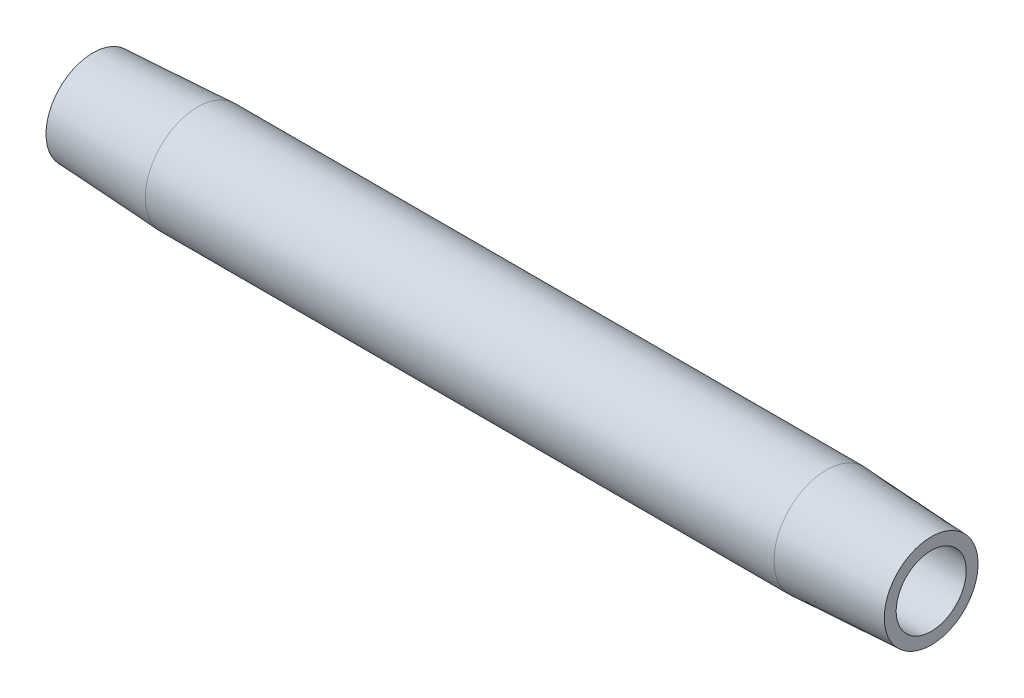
ISO-10303-21;
HEADER;
FILE_DESCRIPTION(('STEP AP214'),'2;1');
FILE_NAME('part.step','',(''),(''),'','','');
FILE_SCHEMA(('AUTOMOTIVE_DESIGN { 1 0 10303 214 1 1 1 1 }'));
ENDSEC;
DATA;
#1=APPLICATION_CONTEXT('core data for automotive mechanical design processes');
#2=APPLICATION_PROTOCOL_DEFINITION('international standard','automotive_design',2000,#1);
#3=PRODUCT_CONTEXT('',#1,'mechanical');
#4=PRODUCT('Part','Part','',(#3));
#5=PRODUCT_RELATED_PRODUCT_CATEGORY('part','',(#4));
#6=PRODUCT_DEFINITION_FORMATION('','',#4);
#7=PRODUCT_DEFINITION_CONTEXT('part definition',#1,'design');
#8=PRODUCT_DEFINITION('design','',#6,#7);
#9=PRODUCT_DEFINITION_SHAPE('','',#8);
#10=(LENGTH_UNIT() NAMED_UNIT(*) SI_UNIT(.MILLI.,.METRE.));
#11=(NAMED_UNIT(*) PLANE_ANGLE_UNIT() SI_UNIT($,.RADIAN.));
#12=(NAMED_UNIT(*) SI_UNIT($,.STERADIAN.) SOLID_ANGLE_UNIT());
#13=UNCERTAINTY_MEASURE_WITH_UNIT(LENGTH_MEASURE(1.E-05),#10,'distance_accuracy_value','');
#14=(GEOMETRIC_REPRESENTATION_CONTEXT(3) GLOBAL_UNCERTAINTY_ASSIGNED_CONTEXT((#13)) GLOBAL_UNIT_ASSIGNED_CONTEXT((#10,
#11,#12)) REPRESENTATION_CONTEXT('',''));
#15=CARTESIAN_POINT('',(0.,0.,0.));
#16=DIRECTION('',(0.,0.,1.));
#17=DIRECTION('',(1.,0.,0.));
#18=AXIS2_PLACEMENT_3D('',#15,#16,#17);
#19=CARTESIAN_POINT('',(0.476141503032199,0.,0.));
#20=DIRECTION('',(-1.,0.,0.));
#21=DIRECTION('',(0.,0.,1.));
#22=AXIS2_PLACEMENT_3D('',#19,#20,#21);
#23=CYLINDRICAL_SURFACE('',#22,3.96875);
#24=CARTESIAN_POINT('',(7.9375,0.,0.));
#25=DIRECTION('',(-1.,0.,0.));
#26=DIRECTION('',(0.,0.,1.));
#27=AXIS2_PLACEMENT_3D('',#24,#25,#26);
#28=CIRCLE('',#27,3.96875);
#29=CARTESIAN_POINT('',(7.9375,0.,3.96875));
#30=VERTEX_POINT('',#29);
#31=EDGE_CURVE('E10',#30,#30,#28,.T.);
#32=ORIENTED_EDGE('',*,*,#31,.F.);
#33=EDGE_LOOP('',(#32));
#34=FACE_BOUND('',#33,.T.);
#35=CARTESIAN_POINT('',(55.5625,0.,0.));
#36=DIRECTION('',(-1.,0.,0.));
#37=DIRECTION('',(0.,0.,1.));
#38=AXIS2_PLACEMENT_3D('',#35,#36,#37);
#39=CIRCLE('',#38,3.96875000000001);
#40=CARTESIAN_POINT('',(55.5625,0.,3.96875000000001));
#41=VERTEX_POINT('',#40);
#42=EDGE_CURVE('E52',#41,#41,#39,.T.);
#43=ORIENTED_EDGE('',*,*,#42,.T.);
#44=EDGE_LOOP('',(#43));
#45=FACE_BOUND('',#44,.T.);
#46=ADVANCED_FACE('F30',(#34,#45),#23,.T.);
#47=CARTESIAN_POINT('',(7.9375,0.,0.));
#48=DIRECTION('',(1.,0.,0.));
#49=DIRECTION('',(0.,0.,-1.));
#50=AXIS2_PLACEMENT_3D('',#47,#48,#49);
#51=CONICAL_SURFACE('',#50,3.96875,0.0523598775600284);
#52=CARTESIAN_POINT('',(0.,0.,0.));
#53=DIRECTION('',(-1.,0.,0.));
#54=DIRECTION('',(0.,0.,1.));
#55=AXIS2_PLACEMENT_3D('',#52,#53,#54);
#56=CIRCLE('',#55,3.55276325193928);
#57=CARTESIAN_POINT('',(0.,0.,3.55276325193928));
#58=VERTEX_POINT('',#57);
#59=EDGE_CURVE('E36',#58,#58,#56,.T.);
#60=ORIENTED_EDGE('',*,*,#59,.F.);
#61=EDGE_LOOP('',(#60));
#62=FACE_BOUND('',#61,.T.);
#63=ORIENTED_EDGE('',*,*,#31,.T.);
#64=EDGE_LOOP('',(#63));
#65=FACE_BOUND('',#64,.T.);
#66=ADVANCED_FACE('F77',(#62,#65),#51,.T.);
#67=CARTESIAN_POINT('',(0.,3.55276325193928,0.));
#68=DIRECTION('',(1.,0.,0.));
#69=DIRECTION('',(0.,0.,-1.));
#70=AXIS2_PLACEMENT_3D('',#67,#68,#69);
#71=PLANE('',#70);
#72=CARTESIAN_POINT('',(0.,0.,0.));
#73=DIRECTION('',(-1.,0.,0.));
#74=DIRECTION('',(0.,0.,1.));
#75=AXIS2_PLACEMENT_3D('',#72,#73,#74);
#76=CIRCLE('',#75,2.65429999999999);
#77=CARTESIAN_POINT('',(0.,0.,2.65429999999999));
#78=VERTEX_POINT('',#77);
#79=EDGE_CURVE('E40',#78,#78,#76,.T.);
#80=ORIENTED_EDGE('',*,*,#79,.F.);
#81=EDGE_LOOP('',(#80));
#82=FACE_BOUND('',#81,.T.);
#83=ORIENTED_EDGE('',*,*,#59,.T.);
#84=EDGE_LOOP('',(#83));
#85=FACE_BOUND('',#84,.T.);
#86=ADVANCED_FACE('F72',(#82,#85),#71,.F.);
#87=CARTESIAN_POINT('',(0.476141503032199,0.,0.));
#88=DIRECTION('',(-1.,0.,0.));
#89=DIRECTION('',(0.,0.,1.));
#90=AXIS2_PLACEMENT_3D('',#87,#88,#89);
#91=CYLINDRICAL_SURFACE('',#90,2.6543);
#92=CARTESIAN_POINT('',(63.5,0.,0.));
#93=DIRECTION('',(-1.,0.,0.));
#94=DIRECTION('',(0.,0.,1.));
#95=AXIS2_PLACEMENT_3D('',#92,#93,#94);
#96=CIRCLE('',#95,2.6543);
#97=CARTESIAN_POINT('',(63.5,0.,2.6543));
#98=VERTEX_POINT('',#97);
#99=EDGE_CURVE('E44',#98,#98,#96,.T.);
#100=ORIENTED_EDGE('',*,*,#99,.F.);
#101=EDGE_LOOP('',(#100));
#102=FACE_BOUND('',#101,.T.);
#103=ORIENTED_EDGE('',*,*,#79,.T.);
#104=EDGE_LOOP('',(#103));
#105=FACE_BOUND('',#104,.T.);
#106=ADVANCED_FACE('F66',(#102,#105),#91,.F.);
#107=CARTESIAN_POINT('',(63.5,2.6543,0.));
#108=DIRECTION('',(-1.,0.,0.));
#109=DIRECTION('',(0.,0.,1.));
#110=AXIS2_PLACEMENT_3D('',#107,#108,#109);
#111=PLANE('',#110);
#112=CARTESIAN_POINT('',(63.5,0.,0.));
#113=DIRECTION('',(-1.,0.,0.));
#114=DIRECTION('',(0.,0.,1.));
#115=AXIS2_PLACEMENT_3D('',#112,#113,#114);
#116=CIRCLE('',#115,3.55276325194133);
#117=CARTESIAN_POINT('',(63.5,0.,3.55276325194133));
#118=VERTEX_POINT('',#117);
#119=EDGE_CURVE('E49',#118,#118,#116,.T.);
#120=ORIENTED_EDGE('',*,*,#119,.F.);
#121=EDGE_LOOP('',(#120));
#122=FACE_BOUND('',#121,.T.);
#123=ORIENTED_EDGE('',*,*,#99,.T.);
#124=EDGE_LOOP('',(#123));
#125=FACE_BOUND('',#124,.T.);
#126=ADVANCED_FACE('F60',(#122,#125),#111,.F.);
#127=CARTESIAN_POINT('',(63.5,0.,0.));
#128=DIRECTION('',(-1.,0.,0.));
#129=DIRECTION('',(0.,0.,1.));
#130=AXIS2_PLACEMENT_3D('',#127,#128,#129);
#131=CONICAL_SURFACE('',#130,3.55276325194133,0.0523598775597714);
#132=ORIENTED_EDGE('',*,*,#42,.F.);
#133=EDGE_LOOP('',(#132));
#134=FACE_BOUND('',#133,.T.);
#135=ORIENTED_EDGE('',*,*,#119,.T.);
#136=EDGE_LOOP('',(#135));
#137=FACE_BOUND('',#136,.T.);
#138=ADVANCED_FACE('F57',(#134,#137),#131,.T.);
#139=CLOSED_SHELL('',(#46,#66,#86,#106,#126,#138));
#140=MANIFOLD_SOLID_BREP('B2',#139);
#141=ADVANCED_BREP_SHAPE_REPRESENTATION('',(#18,#140),#14);
#142=SHAPE_DEFINITION_REPRESENTATION(#9,#141);
ENDSEC;
END-ISO-10303-21;
